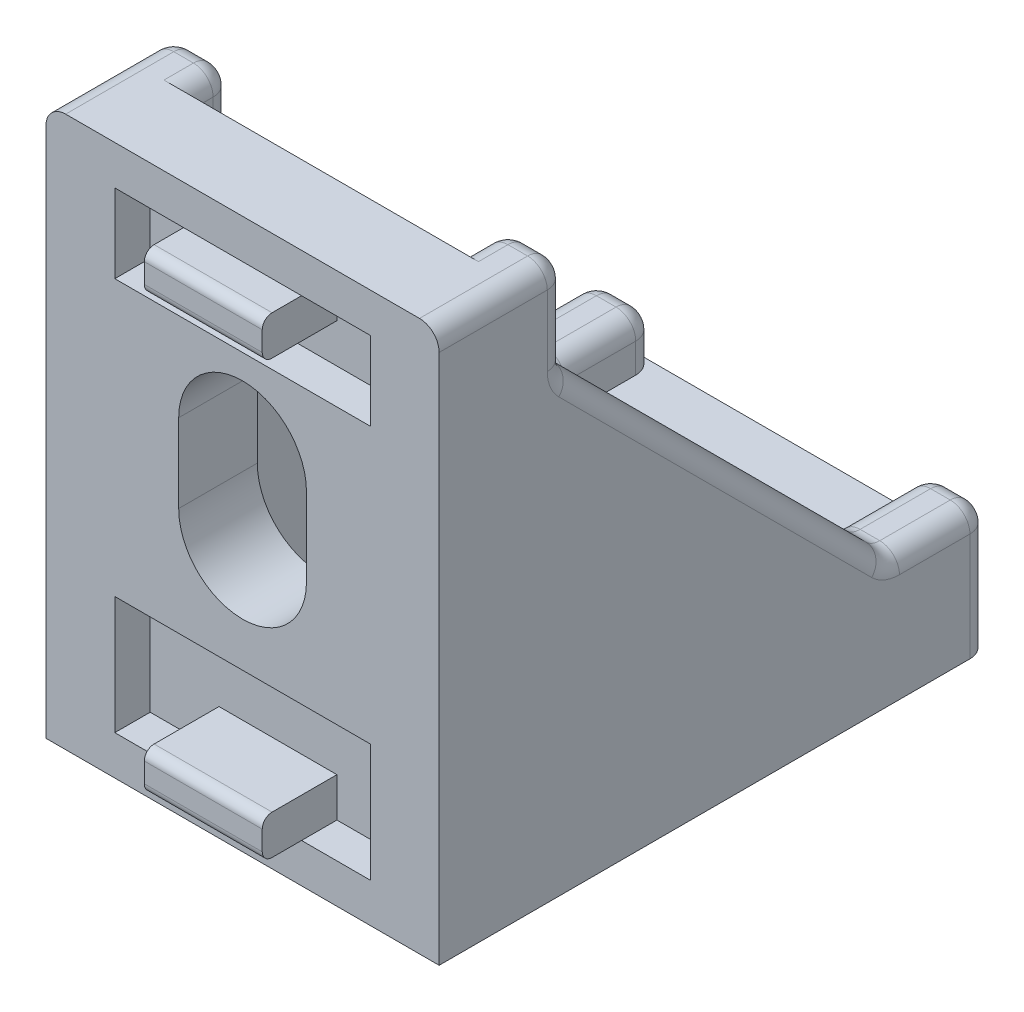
from build123d import *

# Parameters (mm, degrees)
EXTRUDE_1_DEPTH     = 17
EXTRUDE_2_DEPTH     = 3
EXTRUDE_3_DEPTH     = 3
CUT_EXTRUDE_4_DEPTH = 42.952353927
CUT_EXTRUDE_5_DEPTH = 42.952353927
FILLET_22_R         = 1
FILLET_23_R         = 1
FILLET_24_R         = 1
FILLET_25_R         = 1
FILLET_26_R         = 1
FILLET_27_R         = 1
SKETCH_41_W         = 3
SKETCH_41_H         = 2
EXTRUDE_7_DEPTH     = 2
SKETCH_42_W         = 6
SKETCH_42_H         = 2
EXTRUDE_8_DEPTH     = 2
CUT_EXTRUDE_6_DEPTH = 1.8
CUT_EXTRUDE_7_DEPTH = 1.8
FILLET_28_R         = 0.5
FILLET_29_R         = 0.5
FILLET_30_R         = 0.5
FILLET_31_R         = 0.5
FILLET_33_R         = 0.5
FILLET_34_R         = 0.5
FILLET_35_R         = 0.5
FILLET_36_R         = 0.5


with BuildPart() as part:
    # Sketch 3 → Extrude 1 (new body)
    with BuildSketch(Plane(origin=(0, 0, 0), x_dir=(0, 0, -1), z_dir=(1, 0, 0))):
        Polygon((0, 0), (0, 28), (4, 28), (4, 4), (28, 4), (28, 0), align=None)
    extrude(amount=EXTRUDE_1_DEPTH)

    # Sketch 6 → Extrude 2 (add)
    with BuildSketch(Plane(origin=(17, 0, 0), x_dir=(0, 0, -1), z_dir=(1, 0, 0))):
        Polygon((4, 28), (6.5, 28), (6.5, 23), (23, 6.5), (28, 6.5), (28, 4), (28, 0), (0, 0), (0, 28), align=None)
    extrude(amount=EXTRUDE_2_DEPTH)

    # Sketch 8 → Extrude 3 (add)
    with BuildSketch(Plane.ZY):
        Polygon((-4, 28), (-6.5, 28), (-6.5, 23), (-23, 6.5), (-28, 6.5), (-28, 4), (-4, 4), align=None)
    extrude(amount=-EXTRUDE_3_DEPTH)

    # Sketch 30 → Cut-Extrude 4 (cut, through all)
    with BuildSketch(Plane(origin=(0, 0, -4), x_dir=(-1, 0, 0), z_dir=(0, 0, -1))):
        with BuildLine():
            Line((-6.75, 17.5), (-6.75, 13.5))
            ThreePointArc((-6.75, 13.5), (-10, 10.25), (-13.25, 13.5))
            Line((-13.25, 13.5), (-13.25, 17.5))
            ThreePointArc((-13.25, 17.5), (-10, 20.75), (-6.75, 17.5))
        make_face()
    extrude(amount=-CUT_EXTRUDE_4_DEPTH, mode=Mode.SUBTRACT)

    # Sketch 32 → Cut-Extrude 5 (cut, through all)
    with BuildSketch(Plane(origin=(0, 4, 0), x_dir=(1, 0, 0), z_dir=(0, 1, 0))):
        with BuildLine():
            Line((13.25, 17.5), (13.25, 13.5))
            ThreePointArc((13.25, 13.5), (10, 10.25), (6.75, 13.5))
            Line((6.75, 13.5), (6.75, 17.5))
            ThreePointArc((6.75, 17.5), (10, 20.75), (13.25, 17.5))
        make_face()
    extrude(amount=-CUT_EXTRUDE_5_DEPTH, mode=Mode.SUBTRACT)

    # Fillet 22
    fillet_22_edges = [part.edges().sort_by_distance(p)[0] for p in [
        (3, 6.5, -25.5),
        (3, 14.75, -14.75),
        (1.5, 6.5, -23),
        (3, 25.5, -6.5),
        (1.5, 23, -6.5),
        (0, 25.5, -6.5),
        (0, 14.75, -14.75),
        (0, 6.5, -25.5),
    ]]
    fillet(fillet_22_edges, radius=FILLET_22_R)

    # Fillet 23
    fillet_23_edges = [part.edges().sort_by_distance(p)[0] for p in [
        (20, 6.5, -25.5),
        (17, 6.5, -25.5),
        (20, 25.5, -6.5),
        (17, 25.5, -6.5),
        (18.5, 6.5, -23),
        (20, 14.75, -14.75),
        (18.5, 23, -6.5),
        (17, 14.75, -14.75),
    ]]
    fillet(fillet_23_edges, radius=FILLET_23_R)

    # Fillet 24
    fillet_24_edges = [part.edges().sort_by_distance(p)[0] for p in [
        (17, 4.75, -28),
        (17.292893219, 6.207106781, -28),
        (18.5, 6.5, -28),
        (19.707106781, 6.207106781, -28),
        (20, 2.75, -28),
    ]]
    fillet(fillet_24_edges, radius=FILLET_24_R)

    # Fillet 25
    fillet_25_edges = [part.edges().sort_by_distance(p)[0] for p in [
        (0, 2.75, -28),
        (1.5, 6.5, -28),
        (3, 4.75, -28),
        (0.292893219, 6.207106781, -28),
        (2.707106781, 6.207106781, -28),
    ]]
    fillet(fillet_25_edges, radius=FILLET_25_R)

    # Fillet 26
    fillet_26_edges = [part.edges().sort_by_distance(p)[0] for p in [
        (20, 28, -2.75),
        (17, 28, -4.75),
        (18.5, 28, -6.5),
        (17.292893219, 28, -6.207106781),
        (19.707106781, 28, -6.207106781),
    ]]
    fillet(fillet_26_edges, radius=FILLET_26_R)

    # Fillet 27
    fillet_27_edges = [part.edges().sort_by_distance(p)[0] for p in [
        (1.5, 28, -6.5),
        (0.292893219, 28, -6.207106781),
        (2.707106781, 28, -6.207106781),
        (3, 28, -4.75),
        (0, 28, -2.75),
    ]]
    fillet(fillet_27_edges, radius=FILLET_27_R)

    # Sketch 41 → Extrude 7 (add)
    with BuildSketch(Plane.XZ):
        with Locations((11.5, -3)):
            Rectangle(SKETCH_41_W, SKETCH_41_H)
        with Locations((8.5, -3)):
            Rectangle(SKETCH_41_W, SKETCH_41_H)
    extrude_7 = extrude(amount=EXTRUDE_7_DEPTH)

    # Sketch 42 → Extrude 8 (add)
    with BuildSketch(Plane.XZ):
        with Locations((10, -25)):
            Rectangle(SKETCH_42_W, SKETCH_42_H)
    extrude_8 = extrude(amount=EXTRUDE_8_DEPTH)

    # Sketch 43 → Cut-Extrude 6 (cut)
    with BuildSketch(Plane.XZ):
        Polygon((16.5, -8), (16.5, -2), (13, -2), (13, -4), (7, -4), (7, -2), (3.5, -2), (3.5, -8), align=None)
    cut_extrude_6 = extrude(amount=-CUT_EXTRUDE_6_DEPTH, mode=Mode.SUBTRACT)

    # Sketch 48 → Cut-Extrude 7 (cut)
    with BuildSketch(Plane.XZ):
        Polygon((13, -26), (16.5, -26), (16.5, -22), (3.5, -22), (3.5, -26), (7, -26), (7, -24), (13, -24), align=None)
    cut_extrude_7 = extrude(amount=-CUT_EXTRUDE_7_DEPTH, mode=Mode.SUBTRACT)

    # Fillet 28
    fillet_28_edges = [part.edges().sort_by_distance(p)[0] for p in [
        (10, -2, -4),
    ]]
    fillet(fillet_28_edges, radius=FILLET_28_R)

    # Fillet 29
    fillet_29_edges = [part.edges().sort_by_distance(p)[0] for p in [
        (10, -2, -2),
    ]]
    fillet(fillet_29_edges, radius=FILLET_29_R)

    # Fillet 30
    fillet_30_edges = [part.edges().sort_by_distance(p)[0] for p in [
        (10, -2, -26),
    ]]
    fillet(fillet_30_edges, radius=FILLET_30_R)

    # Fillet 31
    fillet_31_edges = [part.edges().sort_by_distance(p)[0] for p in [
        (10, -2, -24),
    ]]
    fillet(fillet_31_edges, radius=FILLET_31_R)

    # Mirror 1: Extrude 7, Extrude 8, Cut-Extrude 6, Cut-Extrude 7 across plane
    add(extrude_7.mirror(Plane(origin=(0, 0, 0), x_dir=(0, -0.7071067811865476, 0.7071067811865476), z_dir=(0, 0.7071067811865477, 0.7071067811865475))))
    add(extrude_8.mirror(Plane(origin=(0, 0, 0), x_dir=(0, -0.7071067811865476, 0.7071067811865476), z_dir=(0, 0.7071067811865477, 0.7071067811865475))))
    add(cut_extrude_6.mirror(Plane(origin=(0, 0, 0), x_dir=(0, -0.7071067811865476, 0.7071067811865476), z_dir=(0, 0.7071067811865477, 0.7071067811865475))), mode=Mode.SUBTRACT)
    add(cut_extrude_7.mirror(Plane(origin=(0, 0, 0), x_dir=(0, -0.7071067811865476, 0.7071067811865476), z_dir=(0, 0.7071067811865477, 0.7071067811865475))), mode=Mode.SUBTRACT)

    # Fillet 33
    fillet_33_edges = [part.edges().sort_by_distance(p)[0] for p in [
        (10, 4, 2),
    ]]
    fillet(fillet_33_edges, radius=FILLET_33_R)

    # Fillet 34
    fillet_34_edges = [part.edges().sort_by_distance(p)[0] for p in [
        (10, 2, 2),
    ]]
    fillet(fillet_34_edges, radius=FILLET_34_R)

    # Fillet 35
    fillet_35_edges = [part.edges().sort_by_distance(p)[0] for p in [
        (10, 24, 2),
    ]]
    fillet(fillet_35_edges, radius=FILLET_35_R)

    # Fillet 36
    fillet_36_edges = [part.edges().sort_by_distance(p)[0] for p in [
        (10, 26, 2),
    ]]
    fillet(fillet_36_edges, radius=FILLET_36_R)


solid = part.part
